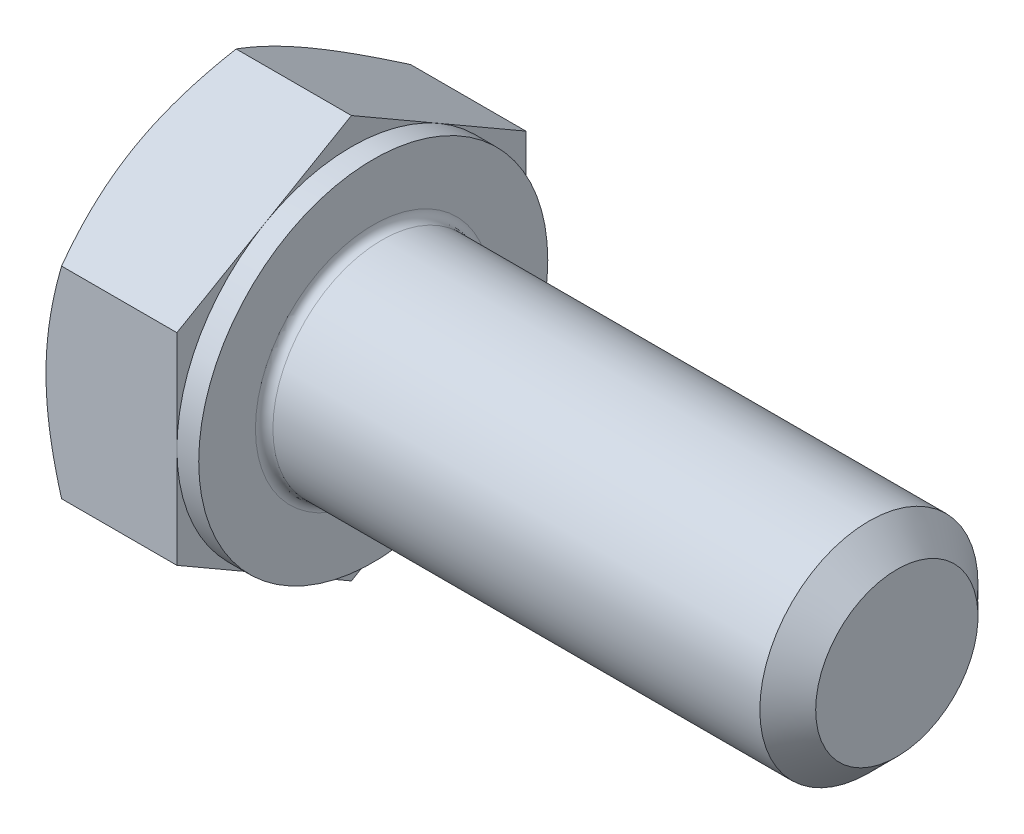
ISO-10303-21;
HEADER;
FILE_DESCRIPTION(('STEP AP214'),'2;1');
FILE_NAME('part.step','',(''),(''),'','','');
FILE_SCHEMA(('AUTOMOTIVE_DESIGN { 1 0 10303 214 1 1 1 1 }'));
ENDSEC;
DATA;
#1=APPLICATION_CONTEXT('core data for automotive mechanical design processes');
#2=APPLICATION_PROTOCOL_DEFINITION('international standard','automotive_design',2000,#1);
#3=PRODUCT_CONTEXT('',#1,'mechanical');
#4=PRODUCT('Part','Part','',(#3));
#5=PRODUCT_RELATED_PRODUCT_CATEGORY('part','',(#4));
#6=PRODUCT_DEFINITION_FORMATION('','',#4);
#7=PRODUCT_DEFINITION_CONTEXT('part definition',#1,'design');
#8=PRODUCT_DEFINITION('design','',#6,#7);
#9=PRODUCT_DEFINITION_SHAPE('','',#8);
#10=(LENGTH_UNIT() NAMED_UNIT(*) SI_UNIT(.MILLI.,.METRE.));
#11=(NAMED_UNIT(*) PLANE_ANGLE_UNIT() SI_UNIT($,.RADIAN.));
#12=(NAMED_UNIT(*) SI_UNIT($,.STERADIAN.) SOLID_ANGLE_UNIT());
#13=UNCERTAINTY_MEASURE_WITH_UNIT(LENGTH_MEASURE(1.E-05),#10,'distance_accuracy_value','');
#14=(GEOMETRIC_REPRESENTATION_CONTEXT(3) GLOBAL_UNCERTAINTY_ASSIGNED_CONTEXT((#13)) GLOBAL_UNIT_ASSIGNED_CONTEXT((#10,
#11,#12)) REPRESENTATION_CONTEXT('',''));
#15=CARTESIAN_POINT('',(0.,0.,0.));
#16=DIRECTION('',(0.,0.,1.));
#17=DIRECTION('',(1.,0.,0.));
#18=AXIS2_PLACEMENT_3D('',#15,#16,#17);
#19=CARTESIAN_POINT('',(3.5,2.3094010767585,-4.));
#20=DIRECTION('',(0.,-0.866025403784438,0.500000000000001));
#21=DIRECTION('',(0.,-0.500000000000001,-0.866025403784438));
#22=AXIS2_PLACEMENT_3D('',#19,#20,#21);
#23=PLANE('',#22);
#24=DIRECTION('',(0.,0.500000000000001,0.866025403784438));
#25=VECTOR('',#24,1.);
#26=CARTESIAN_POINT('',(3.,2.3094010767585,-4.));
#27=LINE('',#26,#25);
#28=CARTESIAN_POINT('',(3.,2.3094010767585,-4.));
#29=VERTEX_POINT('',#28);
#30=CARTESIAN_POINT('',(3.,3.46410161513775,-2.));
#31=VERTEX_POINT('',#30);
#32=EDGE_CURVE('E173',#29,#31,#27,.T.);
#33=ORIENTED_EDGE('',*,*,#32,.F.);
#34=DIRECTION('',(-1.,0.,0.));
#35=VECTOR('',#34,1.);
#36=CARTESIAN_POINT('',(3.5,2.3094010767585,-4.));
#37=LINE('',#36,#35);
#38=CARTESIAN_POINT('',(0.357265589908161,2.3094010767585,-4.));
#39=VERTEX_POINT('',#38);
#40=EDGE_CURVE('E301',#29,#39,#37,.T.);
#41=ORIENTED_EDGE('',*,*,#40,.T.);
#42=CARTESIAN_POINT('',(0.357332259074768,4.61891762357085,0.0002));
#43=CARTESIAN_POINT('',(0.298717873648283,4.51743148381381,-0.175579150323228));
#44=CARTESIAN_POINT('',(0.245410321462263,4.41506932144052,-0.35287561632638));
#45=CARTESIAN_POINT('',(0.152361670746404,4.2085725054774,-0.710538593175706));
#46=CARTESIAN_POINT('',(0.112653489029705,4.10443418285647,-0.890911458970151));
#47=CARTESIAN_POINT('',(0.05084221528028,3.89744813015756,-1.24942181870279));
#48=CARTESIAN_POINT('',(0.0283277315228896,3.7946322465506,-1.42750415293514));
#49=CARTESIAN_POINT('',(0.00145062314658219,3.58851671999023,-1.78450671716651));
#50=CARTESIAN_POINT('',(-0.0029342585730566,3.48521782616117,-1.9634256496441));
#51=CARTESIAN_POINT('',(0.00619007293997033,3.29219970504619,-2.29774284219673));
#52=CARTESIAN_POINT('',(0.0174589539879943,3.20245157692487,-2.45319115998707));
#53=CARTESIAN_POINT('',(0.053173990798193,3.02354002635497,-2.76307505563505));
#54=CARTESIAN_POINT('',(0.0776323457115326,2.93437722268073,-2.91750956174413));
#55=CARTESIAN_POINT('',(0.138776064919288,2.75509682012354,-3.22803232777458));
#56=CARTESIAN_POINT('',(0.175720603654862,2.6650019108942,-3.3840812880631));
#57=CARTESIAN_POINT('',(0.259570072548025,2.48615580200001,-3.69385183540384));
#58=CARTESIAN_POINT('',(0.306455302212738,2.39740231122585,-3.84757739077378));
#59=CARTESIAN_POINT('',(0.357332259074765,2.30928560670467,-4.0002));
#60=B_SPLINE_CURVE_WITH_KNOTS('',3,(#42,#43,#44,#45,#46,#47,#48,#49,#50,#51,#52,#53,#54,#55,#56,
#57,#58,#59),.UNSPECIFIED.,.F.,.F.,(4,2,2,2,2,2,2,2,4),(0.,0.634047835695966,1.26961969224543,
1.88946157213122,2.50854226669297,3.04757825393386,3.58711366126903,4.13861653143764,
4.68903648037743),.UNSPECIFIED.);
#61=CARTESIAN_POINT('',(0.,3.46410161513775,-2.));
#62=VERTEX_POINT('',#61);
#63=EDGE_CURVE('E228',#62,#39,#60,.T.);
#64=ORIENTED_EDGE('',*,*,#63,.F.);
#65=CARTESIAN_POINT('',(0.357265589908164,4.61880215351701,0.));
#66=VERTEX_POINT('',#65);
#67=EDGE_CURVE('E64',#66,#62,#60,.T.);
#68=ORIENTED_EDGE('',*,*,#67,.F.);
#69=DIRECTION('',(-1.,0.,0.));
#70=VECTOR('',#69,1.);
#71=CARTESIAN_POINT('',(3.5,4.61880215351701,0.));
#72=LINE('',#71,#70);
#73=CARTESIAN_POINT('',(3.,4.61880215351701,0.));
#74=VERTEX_POINT('',#73);
#75=EDGE_CURVE('E293',#74,#66,#72,.T.);
#76=ORIENTED_EDGE('',*,*,#75,.F.);
#77=EDGE_CURVE('E171',#31,#74,#27,.T.);
#78=ORIENTED_EDGE('',*,*,#77,.F.);
#79=EDGE_LOOP('',(#33,#41,#64,#68,#76,#78));
#80=FACE_BOUND('',#79,.T.);
#81=ADVANCED_FACE('F41',(#80),#23,.F.);
#82=CARTESIAN_POINT('',(3.5,4.61880215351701,0.));
#83=DIRECTION('',(0.,-0.866025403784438,-0.500000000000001));
#84=DIRECTION('',(0.,0.500000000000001,-0.866025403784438));
#85=AXIS2_PLACEMENT_3D('',#82,#83,#84);
#86=PLANE('',#85);
#87=DIRECTION('',(0.,-0.500000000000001,0.866025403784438));
#88=VECTOR('',#87,1.);
#89=CARTESIAN_POINT('',(3.,4.61880215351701,0.));
#90=LINE('',#89,#88);
#91=CARTESIAN_POINT('',(3.,3.46410161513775,2.));
#92=VERTEX_POINT('',#91);
#93=EDGE_CURVE('E170',#74,#92,#90,.T.);
#94=ORIENTED_EDGE('',*,*,#93,.F.);
#95=ORIENTED_EDGE('',*,*,#75,.T.);
#96=CARTESIAN_POINT('',(0.357332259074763,2.30928560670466,4.0002));
#97=CARTESIAN_POINT('',(0.298717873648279,2.4107717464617,3.82442084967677));
#98=CARTESIAN_POINT('',(0.24541032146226,2.51313390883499,3.64712438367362));
#99=CARTESIAN_POINT('',(0.152361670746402,2.71963072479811,3.28946140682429));
#100=CARTESIAN_POINT('',(0.112653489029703,2.82376904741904,3.10908854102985));
#101=CARTESIAN_POINT('',(0.0508422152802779,3.03075510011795,2.75057818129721));
#102=CARTESIAN_POINT('',(0.0283277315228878,3.13357098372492,2.57249584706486));
#103=CARTESIAN_POINT('',(0.00145062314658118,3.33968651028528,2.21549328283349));
#104=CARTESIAN_POINT('',(-0.00293425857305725,3.44298540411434,2.0365743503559));
#105=CARTESIAN_POINT('',(0.0061900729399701,3.63600352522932,1.70225715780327));
#106=CARTESIAN_POINT('',(0.0174589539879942,3.72575165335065,1.54680884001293));
#107=CARTESIAN_POINT('',(0.0531739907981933,3.90466320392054,1.23692494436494));
#108=CARTESIAN_POINT('',(0.0776323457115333,3.99382600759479,1.08249043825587));
#109=CARTESIAN_POINT('',(0.13877606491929,4.17310641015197,0.771967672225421));
#110=CARTESIAN_POINT('',(0.175720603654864,4.26320131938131,0.615918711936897));
#111=CARTESIAN_POINT('',(0.259570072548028,4.44204742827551,0.30614816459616));
#112=CARTESIAN_POINT('',(0.306455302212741,4.53080091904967,0.15242260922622));
#113=CARTESIAN_POINT('',(0.357332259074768,4.61891762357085,-0.000200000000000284));
#114=B_SPLINE_CURVE_WITH_KNOTS('',3,(#96,#97,#98,#99,#100,#101,#102,#103,#104,#105,#106,#107,
#108,#109,#110,#111,#112,#113),.UNSPECIFIED.,.F.,.F.,(4,2,2,2,2,2,2,2,4),(0.,0.634047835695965,
1.26961969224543,1.88946157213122,2.50854226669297,3.04757825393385,3.58711366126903,
4.13861653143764,4.68903648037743),.UNSPECIFIED.);
#115=CARTESIAN_POINT('',(0.,3.46410161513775,2.));
#116=VERTEX_POINT('',#115);
#117=EDGE_CURVE('E225',#116,#66,#114,.T.);
#118=ORIENTED_EDGE('',*,*,#117,.F.);
#119=CARTESIAN_POINT('',(0.35726558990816,2.3094010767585,4.));
#120=VERTEX_POINT('',#119);
#121=EDGE_CURVE('E239',#120,#116,#114,.T.);
#122=ORIENTED_EDGE('',*,*,#121,.F.);
#123=DIRECTION('',(-1.,0.,0.));
#124=VECTOR('',#123,1.);
#125=CARTESIAN_POINT('',(3.5,2.3094010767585,4.));
#126=LINE('',#125,#124);
#127=CARTESIAN_POINT('',(3.,2.3094010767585,4.));
#128=VERTEX_POINT('',#127);
#129=EDGE_CURVE('E295',#128,#120,#126,.T.);
#130=ORIENTED_EDGE('',*,*,#129,.F.);
#131=EDGE_CURVE('E138',#92,#128,#90,.T.);
#132=ORIENTED_EDGE('',*,*,#131,.F.);
#133=EDGE_LOOP('',(#94,#95,#118,#122,#130,#132));
#134=FACE_BOUND('',#133,.T.);
#135=ADVANCED_FACE('F246',(#134),#86,.F.);
#136=CARTESIAN_POINT('',(3.5,2.3094010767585,4.));
#137=DIRECTION('',(0.,0.,-1.));
#138=DIRECTION('',(0.,1.,0.));
#139=AXIS2_PLACEMENT_3D('',#136,#137,#138);
#140=PLANE('',#139);
#141=DIRECTION('',(0.,-1.,0.));
#142=VECTOR('',#141,1.);
#143=CARTESIAN_POINT('',(3.,2.3094010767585,4.));
#144=LINE('',#143,#142);
#145=CARTESIAN_POINT('',(3.,0.,4.));
#146=VERTEX_POINT('',#145);
#147=EDGE_CURVE('E132',#128,#146,#144,.T.);
#148=ORIENTED_EDGE('',*,*,#147,.F.);
#149=ORIENTED_EDGE('',*,*,#129,.T.);
#150=CARTESIAN_POINT('',(2.00011120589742,-6.30203842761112,4.));
#151=CARTESIAN_POINT('',(1.91454696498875,-6.12645846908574,4.));
#152=CARTESIAN_POINT('',(1.82977515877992,-5.95048585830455,4.));
#153=CARTESIAN_POINT('',(1.66226027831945,-5.59754684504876,4.));
#154=CARTESIAN_POINT('',(1.57951750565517,-5.42058029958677,4.));
#155=CARTESIAN_POINT('',(1.41610926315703,-5.06457985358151,4.));
#156=CARTESIAN_POINT('',(1.33545672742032,-4.88553999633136,4.));
#157=CARTESIAN_POINT('',(1.17732358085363,-4.52607013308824,4.));
#158=CARTESIAN_POINT('',(1.09984282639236,-4.34564019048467,4.));
#159=CARTESIAN_POINT('',(0.946328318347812,-3.97695712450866,4.));
#160=CARTESIAN_POINT('',(0.870432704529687,-3.7886461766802,4.));
#161=CARTESIAN_POINT('',(0.724150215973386,-3.40985798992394,4.));
#162=CARTESIAN_POINT('',(0.653763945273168,-3.21938051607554,4.));
#163=CARTESIAN_POINT('',(0.52027562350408,-2.83628177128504,4.));
#164=CARTESIAN_POINT('',(0.457159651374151,-2.64366539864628,4.));
#165=CARTESIAN_POINT('',(0.340171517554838,-2.25567134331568,4.));
#166=CARTESIAN_POINT('',(0.286296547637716,-2.06029451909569,4.));
#167=CARTESIAN_POINT('',(0.190596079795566,-1.66775019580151,4.));
#168=CARTESIAN_POINT('',(0.148703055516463,-1.47059946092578,4.));
#169=CARTESIAN_POINT('',(0.0792701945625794,-1.07374632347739,4.));
#170=CARTESIAN_POINT('',(0.0517287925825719,-0.874044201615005,4.));
#171=CARTESIAN_POINT('',(0.0135517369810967,-0.475733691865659,4.));
#172=CARTESIAN_POINT('',(0.00269106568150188,-0.277147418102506,4.));
#173=CARTESIAN_POINT('',(-0.0018027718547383,0.120241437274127,4.));
#174=CARTESIAN_POINT('',(0.00456430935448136,0.31904402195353,4.));
#175=CARTESIAN_POINT('',(0.029319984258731,0.653649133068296,4.));
#176=CARTESIAN_POINT('',(0.0433487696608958,0.789796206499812,4.));
#177=CARTESIAN_POINT('',(0.0786650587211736,1.0611517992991,4.));
#178=CARTESIAN_POINT('',(0.0999534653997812,1.1963601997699,4.));
#179=CARTESIAN_POINT('',(0.173595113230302,1.6003610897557,4.));
#180=CARTESIAN_POINT('',(0.235713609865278,1.86739658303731,4.));
#181=CARTESIAN_POINT('',(0.344187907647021,2.26690842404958,4.));
#182=CARTESIAN_POINT('',(0.383434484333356,2.40143348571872,4.));
#183=CARTESIAN_POINT('',(0.466191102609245,2.66917849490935,4.));
#184=CARTESIAN_POINT('',(0.509701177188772,2.8023984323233,4.));
#185=CARTESIAN_POINT('',(0.600271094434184,3.06757339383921,4.));
#186=CARTESIAN_POINT('',(0.647329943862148,3.19952876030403,4.));
#187=CARTESIAN_POINT('',(0.744425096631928,3.46233234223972,4.));
#188=CARTESIAN_POINT('',(0.794461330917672,3.5931805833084,4.));
#189=CARTESIAN_POINT('',(0.933355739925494,3.9462730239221,4.));
#190=CARTESIAN_POINT('',(1.0245987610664,4.16757823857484,4.));
#191=CARTESIAN_POINT('',(1.21247228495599,4.6078984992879,4.));
#192=CARTESIAN_POINT('',(1.30910339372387,4.82691328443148,4.));
#193=CARTESIAN_POINT('',(1.50647026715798,5.26317250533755,4.));
#194=CARTESIAN_POINT('',(1.60720747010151,5.48041628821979,4.));
#195=CARTESIAN_POINT('',(1.81181128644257,5.91342831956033,4.));
#196=CARTESIAN_POINT('',(1.91567799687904,6.12919652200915,3.99999999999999));
#197=CARTESIAN_POINT('',(2.12601769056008,6.55988022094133,3.99999999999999));
#198=CARTESIAN_POINT('',(2.23249454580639,6.77479382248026,3.99999999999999));
#199=CARTESIAN_POINT('',(2.44739203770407,7.20364803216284,3.99999999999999));
#200=CARTESIAN_POINT('',(2.55581269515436,7.41758862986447,3.99999999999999));
#201=CARTESIAN_POINT('',(2.88334503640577,8.05812603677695,3.99999999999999));
#202=CARTESIAN_POINT('',(3.10477549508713,8.48353660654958,3.99999999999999));
#203=CARTESIAN_POINT('',(3.52798949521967,9.28704830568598,3.99999999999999));
#204=CARTESIAN_POINT('',(3.72935795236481,9.66536913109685,3.99999999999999));
#205=CARTESIAN_POINT('',(4.13451859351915,10.4207405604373,3.99999999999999));
#206=CARTESIAN_POINT('',(4.33831092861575,10.7977910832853,3.99999999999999));
#207=CARTESIAN_POINT('',(4.74699525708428,11.5496417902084,3.99999999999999));
#208=CARTESIAN_POINT('',(4.95188119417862,11.9244452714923,3.99999999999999));
#209=CARTESIAN_POINT('',(5.36302659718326,12.6732594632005,3.99999999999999));
#210=CARTESIAN_POINT('',(5.56928595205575,13.0472702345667,3.99999999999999));
#211=CARTESIAN_POINT('',(5.7760450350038,13.42100281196,3.99999999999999));
#212=B_SPLINE_CURVE_WITH_KNOTS('',3,(#150,#151,#152,#153,#154,#155,#156,#157,#158,#159,#160,
#161,#162,#163,#164,#165,#166,#167,#168,#169,#170,#171,#172,#173,#174,#175,#176,#177,#178,#179,
#180,#181,#182,#183,#184,#185,#186,#187,#188,#189,#190,#191,#192,#193,#194,#195,#196,#197,#198,
#199,#200,#201,#202,#203,#204,#205,#206,#207,#208,#209,#210,#211),.UNSPECIFIED.,.F.,.F.,(4,2,2,
2,2,2,2,2,2,2,2,2,2,2,2,2,2,2,2,2,2,2,2,2,2,2,2,2,2,2,4),(0.,0.585964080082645,1.17201473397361,
1.76109183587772,2.35014223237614,2.95916537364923,3.56825519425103,4.17615863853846,
4.78387701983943,5.38809979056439,5.99225664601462,6.58818973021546,7.18413137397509,
7.59453803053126,8.00499575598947,8.82630884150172,9.24666973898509,9.66703388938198,
10.0872808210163,10.5075180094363,11.2255416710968,11.9436462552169,12.6620045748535,
13.3803851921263,14.0999050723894,14.8194326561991,16.2581595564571,17.5438734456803,
18.8296679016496,20.1111105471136,21.3924508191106),.UNSPECIFIED.);
#213=CARTESIAN_POINT('',(0.,0.,4.));
#214=VERTEX_POINT('',#213);
#215=EDGE_CURVE('E240',#214,#120,#212,.T.);
#216=ORIENTED_EDGE('',*,*,#215,.F.);
#217=CARTESIAN_POINT('',(0.357265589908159,-2.3094010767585,4.));
#218=VERTEX_POINT('',#217);
#219=EDGE_CURVE('E302',#218,#214,#212,.T.);
#220=ORIENTED_EDGE('',*,*,#219,.F.);
#221=DIRECTION('',(-1.,0.,0.));
#222=VECTOR('',#221,1.);
#223=CARTESIAN_POINT('',(3.5,-2.3094010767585,4.));
#224=LINE('',#223,#222);
#225=CARTESIAN_POINT('',(3.,-2.3094010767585,4.));
#226=VERTEX_POINT('',#225);
#227=EDGE_CURVE('E164',#226,#218,#224,.T.);
#228=ORIENTED_EDGE('',*,*,#227,.F.);
#229=EDGE_CURVE('E142',#146,#226,#144,.T.);
#230=ORIENTED_EDGE('',*,*,#229,.F.);
#231=EDGE_LOOP('',(#148,#149,#216,#220,#228,#230));
#232=FACE_BOUND('',#231,.T.);
#233=ADVANCED_FACE('F162',(#232),#140,.F.);
#234=CARTESIAN_POINT('',(3.5,-4.618802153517,0.));
#235=DIRECTION('',(0.,0.866025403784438,-0.500000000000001));
#236=DIRECTION('',(0.,0.500000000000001,0.866025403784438));
#237=AXIS2_PLACEMENT_3D('',#234,#235,#236);
#238=PLANE('',#237);
#239=DIRECTION('',(0.,-0.500000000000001,-0.866025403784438));
#240=VECTOR('',#239,1.);
#241=CARTESIAN_POINT('',(3.,-4.618802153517,0.));
#242=LINE('',#241,#240);
#243=CARTESIAN_POINT('',(3.,-3.46410161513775,2.));
#244=VERTEX_POINT('',#243);
#245=EDGE_CURVE('E149',#226,#244,#242,.T.);
#246=ORIENTED_EDGE('',*,*,#245,.F.);
#247=ORIENTED_EDGE('',*,*,#227,.T.);
#248=CARTESIAN_POINT('',(0.357332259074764,-4.61891762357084,-0.000199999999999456));
#249=CARTESIAN_POINT('',(0.29871787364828,-4.5174314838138,0.175579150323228));
#250=CARTESIAN_POINT('',(0.24541032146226,-4.41506932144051,0.352875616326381));
#251=CARTESIAN_POINT('',(0.152361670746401,-4.20857250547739,0.710538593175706));
#252=CARTESIAN_POINT('',(0.112653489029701,-4.10443418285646,0.890911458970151));
#253=CARTESIAN_POINT('',(0.0508422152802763,-3.89744813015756,1.24942181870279));
#254=CARTESIAN_POINT('',(0.0283277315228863,-3.79463224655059,1.42750415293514));
#255=CARTESIAN_POINT('',(0.00145062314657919,-3.58851671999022,1.78450671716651));
#256=CARTESIAN_POINT('',(-0.00293425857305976,-3.48521782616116,1.9634256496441));
#257=CARTESIAN_POINT('',(0.0061900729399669,-3.29219970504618,2.29774284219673));
#258=CARTESIAN_POINT('',(0.0174589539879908,-3.20245157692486,2.45319115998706));
#259=CARTESIAN_POINT('',(0.0531739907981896,-3.02354002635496,2.76307505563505));
#260=CARTESIAN_POINT('',(0.0776323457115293,-2.93437722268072,2.91750956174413));
#261=CARTESIAN_POINT('',(0.138776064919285,-2.75509682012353,3.22803232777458));
#262=CARTESIAN_POINT('',(0.17572060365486,-2.66500191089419,3.3840812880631));
#263=CARTESIAN_POINT('',(0.259570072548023,-2.486155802,3.69385183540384));
#264=CARTESIAN_POINT('',(0.306455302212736,-2.39740231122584,3.84757739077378));
#265=CARTESIAN_POINT('',(0.357332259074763,-2.30928560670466,4.0002));
#266=B_SPLINE_CURVE_WITH_KNOTS('',3,(#248,#249,#250,#251,#252,#253,#254,#255,#256,#257,#258,
#259,#260,#261,#262,#263,#264,#265),.UNSPECIFIED.,.F.,.F.,(4,2,2,2,2,2,2,2,4),(0.,
0.634047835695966,1.26961969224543,1.88946157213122,2.50854226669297,3.04757825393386,
3.58711366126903,4.13861653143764,4.68903648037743),.UNSPECIFIED.);
#267=CARTESIAN_POINT('',(0.,-3.46410161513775,2.));
#268=VERTEX_POINT('',#267);
#269=EDGE_CURVE('E227',#268,#218,#266,.T.);
#270=ORIENTED_EDGE('',*,*,#269,.F.);
#271=CARTESIAN_POINT('',(0.357265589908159,-4.618802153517,0.));
#272=VERTEX_POINT('',#271);
#273=EDGE_CURVE('E219',#272,#268,#266,.T.);
#274=ORIENTED_EDGE('',*,*,#273,.F.);
#275=DIRECTION('',(-1.,0.,0.));
#276=VECTOR('',#275,1.);
#277=CARTESIAN_POINT('',(3.5,-4.618802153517,0.));
#278=LINE('',#277,#276);
#279=CARTESIAN_POINT('',(3.,-4.618802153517,0.));
#280=VERTEX_POINT('',#279);
#281=EDGE_CURVE('E298',#280,#272,#278,.T.);
#282=ORIENTED_EDGE('',*,*,#281,.F.);
#283=EDGE_CURVE('E165',#244,#280,#242,.T.);
#284=ORIENTED_EDGE('',*,*,#283,.F.);
#285=EDGE_LOOP('',(#246,#247,#270,#274,#282,#284));
#286=FACE_BOUND('',#285,.T.);
#287=ADVANCED_FACE('F210',(#286),#238,.F.);
#288=CARTESIAN_POINT('',(3.5,-2.3094010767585,-4.));
#289=DIRECTION('',(0.,0.866025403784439,0.5));
#290=DIRECTION('',(0.,-0.5,0.866025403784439));
#291=AXIS2_PLACEMENT_3D('',#288,#289,#290);
#292=PLANE('',#291);
#293=DIRECTION('',(0.,0.5,-0.866025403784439));
#294=VECTOR('',#293,1.);
#295=CARTESIAN_POINT('',(3.,-2.3094010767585,-4.));
#296=LINE('',#295,#294);
#297=CARTESIAN_POINT('',(3.,-3.46410161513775,-2.));
#298=VERTEX_POINT('',#297);
#299=EDGE_CURVE('E348',#280,#298,#296,.T.);
#300=ORIENTED_EDGE('',*,*,#299,.F.);
#301=ORIENTED_EDGE('',*,*,#281,.T.);
#302=CARTESIAN_POINT('',(0.357332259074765,-2.30928560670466,-4.0002));
#303=CARTESIAN_POINT('',(0.298717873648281,-2.4107717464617,-3.82442084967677));
#304=CARTESIAN_POINT('',(0.245410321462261,-2.51313390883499,-3.64712438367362));
#305=CARTESIAN_POINT('',(0.152361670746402,-2.71963072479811,-3.28946140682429));
#306=CARTESIAN_POINT('',(0.112653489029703,-2.82376904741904,-3.10908854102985));
#307=CARTESIAN_POINT('',(0.0508422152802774,-3.03075510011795,-2.75057818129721));
#308=CARTESIAN_POINT('',(0.028327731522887,-3.13357098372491,-2.57249584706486));
#309=CARTESIAN_POINT('',(0.00145062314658,-3.33968651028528,-2.21549328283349));
#310=CARTESIAN_POINT('',(-0.00293425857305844,-3.44298540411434,-2.0365743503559));
#311=CARTESIAN_POINT('',(0.00619007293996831,-3.63600352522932,-1.70225715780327));
#312=CARTESIAN_POINT('',(0.0174589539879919,-3.72575165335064,-1.54680884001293));
#313=CARTESIAN_POINT('',(0.0531739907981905,-3.90466320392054,-1.23692494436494));
#314=CARTESIAN_POINT('',(0.0776323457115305,-3.99382600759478,-1.08249043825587));
#315=CARTESIAN_POINT('',(0.138776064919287,-4.17310641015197,-0.771967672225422));
#316=CARTESIAN_POINT('',(0.17572060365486,-4.26320131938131,-0.615918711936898));
#317=CARTESIAN_POINT('',(0.259570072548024,-4.4420474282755,-0.306148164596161));
#318=CARTESIAN_POINT('',(0.306455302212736,-4.53080091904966,-0.152422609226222));
#319=CARTESIAN_POINT('',(0.357332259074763,-4.61891762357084,0.000199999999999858));
#320=B_SPLINE_CURVE_WITH_KNOTS('',3,(#302,#303,#304,#305,#306,#307,#308,#309,#310,#311,#312,
#313,#314,#315,#316,#317,#318,#319),.UNSPECIFIED.,.F.,.F.,(4,2,2,2,2,2,2,2,4),(0.,
0.634047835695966,1.26961969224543,1.88946157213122,2.50854226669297,3.04757825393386,
3.58711366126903,4.13861653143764,4.68903648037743),.UNSPECIFIED.);
#321=CARTESIAN_POINT('',(0.,-3.46410161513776,-2.));
#322=VERTEX_POINT('',#321);
#323=EDGE_CURVE('E226',#322,#272,#320,.T.);
#324=ORIENTED_EDGE('',*,*,#323,.F.);
#325=CARTESIAN_POINT('',(0.357265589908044,-2.30940107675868,-4.));
#326=VERTEX_POINT('',#325);
#327=EDGE_CURVE('E187',#326,#322,#320,.T.);
#328=ORIENTED_EDGE('',*,*,#327,.F.);
#329=DIRECTION('',(-1.,0.,0.));
#330=VECTOR('',#329,1.);
#331=CARTESIAN_POINT('',(3.5,-2.3094010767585,-4.));
#332=LINE('',#331,#330);
#333=CARTESIAN_POINT('',(3.,-2.3094010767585,-4.));
#334=VERTEX_POINT('',#333);
#335=EDGE_CURVE('E300',#334,#326,#332,.T.);
#336=ORIENTED_EDGE('',*,*,#335,.F.);
#337=EDGE_CURVE('E160',#298,#334,#296,.T.);
#338=ORIENTED_EDGE('',*,*,#337,.F.);
#339=EDGE_LOOP('',(#300,#301,#324,#328,#336,#338));
#340=FACE_BOUND('',#339,.T.);
#341=ADVANCED_FACE('F203',(#340),#292,.F.);
#342=CARTESIAN_POINT('',(3.5,2.3094010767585,-4.));
#343=DIRECTION('',(0.,0.,1.));
#344=DIRECTION('',(0.,-1.,0.));
#345=AXIS2_PLACEMENT_3D('',#342,#343,#344);
#346=PLANE('',#345);
#347=DIRECTION('',(0.,1.,0.));
#348=VECTOR('',#347,1.);
#349=CARTESIAN_POINT('',(3.,2.3094010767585,-4.));
#350=LINE('',#349,#348);
#351=CARTESIAN_POINT('',(3.,0.,-4.));
#352=VERTEX_POINT('',#351);
#353=EDGE_CURVE('E272',#334,#352,#350,.T.);
#354=ORIENTED_EDGE('',*,*,#353,.F.);
#355=ORIENTED_EDGE('',*,*,#335,.T.);
#356=CARTESIAN_POINT('',(2.00011120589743,-6.30203842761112,-4.));
#357=CARTESIAN_POINT('',(1.91454696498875,-6.12645846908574,-4.));
#358=CARTESIAN_POINT('',(1.82977515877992,-5.95048585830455,-4.));
#359=CARTESIAN_POINT('',(1.66226027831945,-5.59754684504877,-4.));
#360=CARTESIAN_POINT('',(1.57951750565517,-5.42058029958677,-4.));
#361=CARTESIAN_POINT('',(1.41610926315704,-5.06457985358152,-4.));
#362=CARTESIAN_POINT('',(1.33545672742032,-4.88553999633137,-4.));
#363=CARTESIAN_POINT('',(1.17732358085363,-4.52607013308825,-4.));
#364=CARTESIAN_POINT('',(1.09984282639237,-4.34564019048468,-4.));
#365=CARTESIAN_POINT('',(0.946328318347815,-3.97695712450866,-4.));
#366=CARTESIAN_POINT('',(0.87043270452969,-3.78864617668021,-4.));
#367=CARTESIAN_POINT('',(0.724150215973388,-3.40985798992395,-4.));
#368=CARTESIAN_POINT('',(0.65376394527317,-3.21938051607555,-4.));
#369=CARTESIAN_POINT('',(0.520275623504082,-2.83628177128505,-4.));
#370=CARTESIAN_POINT('',(0.457159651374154,-2.64366539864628,-4.));
#371=CARTESIAN_POINT('',(0.34017151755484,-2.25567134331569,-4.));
#372=CARTESIAN_POINT('',(0.286296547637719,-2.0602945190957,-4.));
#373=CARTESIAN_POINT('',(0.190596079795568,-1.66775019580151,-4.));
#374=CARTESIAN_POINT('',(0.148703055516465,-1.47059946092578,-4.));
#375=CARTESIAN_POINT('',(0.0792701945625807,-1.07374632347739,-4.));
#376=CARTESIAN_POINT('',(0.051728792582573,-0.874044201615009,-4.));
#377=CARTESIAN_POINT('',(0.0135517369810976,-0.475733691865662,-4.));
#378=CARTESIAN_POINT('',(0.0026910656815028,-0.277147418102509,-4.));
#379=CARTESIAN_POINT('',(-0.0018027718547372,0.120241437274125,-4.));
#380=CARTESIAN_POINT('',(0.00456430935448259,0.319044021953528,-4.));
#381=CARTESIAN_POINT('',(0.0293199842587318,0.653649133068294,-4.));
#382=CARTESIAN_POINT('',(0.0433487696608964,0.78979620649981,-4.));
#383=CARTESIAN_POINT('',(0.078665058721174,1.06115179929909,-4.));
#384=CARTESIAN_POINT('',(0.0999534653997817,1.19636019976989,-4.));
#385=CARTESIAN_POINT('',(0.173595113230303,1.6003610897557,-4.));
#386=CARTESIAN_POINT('',(0.235713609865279,1.86739658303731,-4.));
#387=CARTESIAN_POINT('',(0.344187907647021,2.26690842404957,-4.));
#388=CARTESIAN_POINT('',(0.383434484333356,2.40143348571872,-4.));
#389=CARTESIAN_POINT('',(0.466191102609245,2.66917849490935,-4.));
#390=CARTESIAN_POINT('',(0.509701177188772,2.8023984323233,-4.));
#391=CARTESIAN_POINT('',(0.600271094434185,3.06757339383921,-4.));
#392=CARTESIAN_POINT('',(0.647329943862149,3.19952876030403,-4.));
#393=CARTESIAN_POINT('',(0.744425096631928,3.46233234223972,-4.));
#394=CARTESIAN_POINT('',(0.794461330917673,3.5931805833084,-4.));
#395=CARTESIAN_POINT('',(0.933355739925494,3.9462730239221,-4.));
#396=CARTESIAN_POINT('',(1.0245987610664,4.16757823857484,-4.));
#397=CARTESIAN_POINT('',(1.21247228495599,4.6078984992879,-4.));
#398=CARTESIAN_POINT('',(1.30910339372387,4.82691328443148,-4.));
#399=CARTESIAN_POINT('',(1.50647026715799,5.26317250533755,-4.));
#400=CARTESIAN_POINT('',(1.60720747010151,5.48041628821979,-4.));
#401=CARTESIAN_POINT('',(1.81181128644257,5.91342831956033,-4.));
#402=CARTESIAN_POINT('',(1.91567799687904,6.12919652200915,-4.));
#403=CARTESIAN_POINT('',(2.12601769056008,6.55988022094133,-4.));
#404=CARTESIAN_POINT('',(2.23249454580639,6.77479382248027,-4.));
#405=CARTESIAN_POINT('',(2.44739203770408,7.20364803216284,-4.));
#406=CARTESIAN_POINT('',(2.55581269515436,7.41758862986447,-4.));
#407=CARTESIAN_POINT('',(2.88334503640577,8.05812603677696,-4.));
#408=CARTESIAN_POINT('',(3.10477549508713,8.48353660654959,-4.));
#409=CARTESIAN_POINT('',(3.52798949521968,9.28704830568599,-4.));
#410=CARTESIAN_POINT('',(3.72935795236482,9.66536913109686,-4.));
#411=CARTESIAN_POINT('',(4.13451859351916,10.4207405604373,-4.));
#412=CARTESIAN_POINT('',(4.33831092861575,10.7977910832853,-3.99999999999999));
#413=CARTESIAN_POINT('',(4.74699525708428,11.5496417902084,-3.99999999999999));
#414=CARTESIAN_POINT('',(4.95188119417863,11.9244452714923,-3.99999999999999));
#415=CARTESIAN_POINT('',(5.36302659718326,12.6732594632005,-3.99999999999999));
#416=CARTESIAN_POINT('',(5.56928595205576,13.0472702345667,-3.99999999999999));
#417=CARTESIAN_POINT('',(5.7760450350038,13.42100281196,-3.99999999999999));
#418=B_SPLINE_CURVE_WITH_KNOTS('',3,(#356,#357,#358,#359,#360,#361,#362,#363,#364,#365,#366,
#367,#368,#369,#370,#371,#372,#373,#374,#375,#376,#377,#378,#379,#380,#381,#382,#383,#384,#385,
#386,#387,#388,#389,#390,#391,#392,#393,#394,#395,#396,#397,#398,#399,#400,#401,#402,#403,#404,
#405,#406,#407,#408,#409,#410,#411,#412,#413,#414,#415,#416,#417),.UNSPECIFIED.,.F.,.F.,(4,2,2,
2,2,2,2,2,2,2,2,2,2,2,2,2,2,2,2,2,2,2,2,2,2,2,2,2,2,2,4),(0.,0.585964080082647,1.17201473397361,
1.76109183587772,2.35014223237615,2.95916537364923,3.56825519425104,4.17615863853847,
4.78387701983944,5.38809979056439,5.99225664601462,6.58818973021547,7.1841313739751,
7.59453803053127,8.00499575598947,8.82630884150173,9.2466697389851,9.66703388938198,
10.0872808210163,10.5075180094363,11.2255416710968,11.9436462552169,12.6620045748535,
13.3803851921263,14.0999050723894,14.8194326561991,16.2581595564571,17.5438734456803,
18.8296679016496,20.1111105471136,21.3924508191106),.UNSPECIFIED.);
#419=CARTESIAN_POINT('',(0.,0.,-4.));
#420=VERTEX_POINT('',#419);
#421=EDGE_CURVE('E177',#420,#326,#418,.F.);
#422=ORIENTED_EDGE('',*,*,#421,.F.);
#423=EDGE_CURVE('E186',#39,#420,#418,.F.);
#424=ORIENTED_EDGE('',*,*,#423,.F.);
#425=ORIENTED_EDGE('',*,*,#40,.F.);
#426=EDGE_CURVE('E276',#352,#29,#350,.T.);
#427=ORIENTED_EDGE('',*,*,#426,.F.);
#428=EDGE_LOOP('',(#354,#355,#422,#424,#425,#427));
#429=FACE_BOUND('',#428,.T.);
#430=ADVANCED_FACE('F198',(#429),#346,.F.);
#431=CARTESIAN_POINT('',(0.,0.,0.));
#432=DIRECTION('',(1.,0.,0.));
#433=DIRECTION('',(0.,0.,-1.));
#434=AXIS2_PLACEMENT_3D('',#431,#432,#433);
#435=CONICAL_SURFACE('',#434,4.,1.0471975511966);
#436=ORIENTED_EDGE('',*,*,#327,.T.);
#437=CARTESIAN_POINT('',(0.,0.,0.));
#438=DIRECTION('',(1.,0.,0.));
#439=DIRECTION('',(0.,0.,-1.));
#440=AXIS2_PLACEMENT_3D('',#437,#438,#439);
#441=CIRCLE('',#440,4.);
#442=EDGE_CURVE('E289',#322,#420,#441,.T.);
#443=ORIENTED_EDGE('',*,*,#442,.T.);
#444=ORIENTED_EDGE('',*,*,#421,.T.);
#445=EDGE_LOOP('',(#436,#443,#444));
#446=FACE_BOUND('',#445,.T.);
#447=ADVANCED_FACE('F202',(#446),#435,.T.);
#448=ORIENTED_EDGE('',*,*,#273,.T.);
#449=EDGE_CURVE('E292',#268,#322,#441,.T.);
#450=ORIENTED_EDGE('',*,*,#449,.T.);
#451=ORIENTED_EDGE('',*,*,#323,.T.);
#452=EDGE_LOOP('',(#448,#450,#451));
#453=FACE_BOUND('',#452,.T.);
#454=ADVANCED_FACE('F345',(#453),#435,.T.);
#455=ORIENTED_EDGE('',*,*,#219,.T.);
#456=EDGE_CURVE('E322',#214,#268,#441,.T.);
#457=ORIENTED_EDGE('',*,*,#456,.T.);
#458=ORIENTED_EDGE('',*,*,#269,.T.);
#459=EDGE_LOOP('',(#455,#457,#458));
#460=FACE_BOUND('',#459,.T.);
#461=ADVANCED_FACE('F194',(#460),#435,.T.);
#462=ORIENTED_EDGE('',*,*,#215,.T.);
#463=ORIENTED_EDGE('',*,*,#121,.T.);
#464=CARTESIAN_POINT('',(0.,0.,0.));
#465=DIRECTION('',(-1.,0.,0.));
#466=DIRECTION('',(0.,0.,1.));
#467=AXIS2_PLACEMENT_3D('',#464,#465,#466);
#468=CIRCLE('',#467,4.);
#469=EDGE_CURVE('E174',#214,#116,#468,.T.);
#470=ORIENTED_EDGE('',*,*,#469,.F.);
#471=EDGE_LOOP('',(#462,#463,#470));
#472=FACE_BOUND('',#471,.T.);
#473=ADVANCED_FACE('F316',(#472),#435,.T.);
#474=ORIENTED_EDGE('',*,*,#117,.T.);
#475=ORIENTED_EDGE('',*,*,#67,.T.);
#476=EDGE_CURVE('E287',#62,#116,#441,.T.);
#477=ORIENTED_EDGE('',*,*,#476,.T.);
#478=EDGE_LOOP('',(#474,#475,#477));
#479=FACE_BOUND('',#478,.T.);
#480=ADVANCED_FACE('F320',(#479),#435,.T.);
#481=ORIENTED_EDGE('',*,*,#63,.T.);
#482=ORIENTED_EDGE('',*,*,#423,.T.);
#483=EDGE_CURVE('E286',#420,#62,#441,.T.);
#484=ORIENTED_EDGE('',*,*,#483,.T.);
#485=EDGE_LOOP('',(#481,#482,#484));
#486=FACE_BOUND('',#485,.T.);
#487=ADVANCED_FACE('F336',(#486),#435,.T.);
#488=CARTESIAN_POINT('',(0.,4.61880215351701,0.));
#489=DIRECTION('',(1.,0.,0.));
#490=DIRECTION('',(0.,0.,-1.));
#491=AXIS2_PLACEMENT_3D('',#488,#489,#490);
#492=PLANE('',#491);
#493=ORIENTED_EDGE('',*,*,#483,.F.);
#494=ORIENTED_EDGE('',*,*,#442,.F.);
#495=ORIENTED_EDGE('',*,*,#449,.F.);
#496=ORIENTED_EDGE('',*,*,#456,.F.);
#497=ORIENTED_EDGE('',*,*,#469,.T.);
#498=ORIENTED_EDGE('',*,*,#476,.F.);
#499=EDGE_LOOP('',(#493,#494,#495,#496,#497,#498));
#500=FACE_BOUND('',#499,.T.);
#501=ADVANCED_FACE('F205',(#500),#492,.F.);
#502=CARTESIAN_POINT('',(3.,4.,0.));
#503=DIRECTION('',(1.,0.,0.));
#504=DIRECTION('',(0.,0.,-1.));
#505=AXIS2_PLACEMENT_3D('',#502,#503,#504);
#506=PLANE('',#505);
#507=ORIENTED_EDGE('',*,*,#32,.T.);
#508=CARTESIAN_POINT('',(3.,0.,0.));
#509=DIRECTION('',(-1.,0.,0.));
#510=DIRECTION('',(0.,0.,1.));
#511=AXIS2_PLACEMENT_3D('',#508,#509,#510);
#512=CIRCLE('',#511,4.);
#513=EDGE_CURVE('E56',#31,#352,#512,.T.);
#514=ORIENTED_EDGE('',*,*,#513,.T.);
#515=ORIENTED_EDGE('',*,*,#426,.T.);
#516=EDGE_LOOP('',(#507,#514,#515));
#517=FACE_BOUND('',#516,.T.);
#518=ADVANCED_FACE('F354',(#517),#506,.T.);
#519=ORIENTED_EDGE('',*,*,#77,.T.);
#520=ORIENTED_EDGE('',*,*,#93,.T.);
#521=EDGE_CURVE('E159',#92,#31,#512,.T.);
#522=ORIENTED_EDGE('',*,*,#521,.T.);
#523=EDGE_LOOP('',(#519,#520,#522));
#524=FACE_BOUND('',#523,.T.);
#525=ADVANCED_FACE('F356',(#524),#506,.T.);
#526=ORIENTED_EDGE('',*,*,#131,.T.);
#527=ORIENTED_EDGE('',*,*,#147,.T.);
#528=EDGE_CURVE('E136',#146,#92,#512,.T.);
#529=ORIENTED_EDGE('',*,*,#528,.T.);
#530=EDGE_LOOP('',(#526,#527,#529));
#531=FACE_BOUND('',#530,.T.);
#532=ADVANCED_FACE('F134',(#531),#506,.T.);
#533=ORIENTED_EDGE('',*,*,#229,.T.);
#534=ORIENTED_EDGE('',*,*,#245,.T.);
#535=EDGE_CURVE('E146',#244,#146,#512,.T.);
#536=ORIENTED_EDGE('',*,*,#535,.T.);
#537=EDGE_LOOP('',(#533,#534,#536));
#538=FACE_BOUND('',#537,.T.);
#539=ADVANCED_FACE('F147',(#538),#506,.T.);
#540=ORIENTED_EDGE('',*,*,#283,.T.);
#541=ORIENTED_EDGE('',*,*,#299,.T.);
#542=EDGE_CURVE('E153',#298,#244,#512,.T.);
#543=ORIENTED_EDGE('',*,*,#542,.T.);
#544=EDGE_LOOP('',(#540,#541,#543));
#545=FACE_BOUND('',#544,.T.);
#546=ADVANCED_FACE('F370',(#545),#506,.T.);
#547=ORIENTED_EDGE('',*,*,#337,.T.);
#548=ORIENTED_EDGE('',*,*,#353,.T.);
#549=EDGE_CURVE('E353',#352,#298,#512,.T.);
#550=ORIENTED_EDGE('',*,*,#549,.T.);
#551=EDGE_LOOP('',(#547,#548,#550));
#552=FACE_BOUND('',#551,.T.);
#553=ADVANCED_FACE('F351',(#552),#506,.T.);
#554=CARTESIAN_POINT('',(0.,0.,0.));
#555=DIRECTION('',(-1.,0.,0.));
#556=DIRECTION('',(0.,0.,1.));
#557=AXIS2_PLACEMENT_3D('',#554,#555,#556);
#558=CYLINDRICAL_SURFACE('',#557,4.);
#559=ORIENTED_EDGE('',*,*,#513,.F.);
#560=ORIENTED_EDGE('',*,*,#521,.F.);
#561=ORIENTED_EDGE('',*,*,#528,.F.);
#562=ORIENTED_EDGE('',*,*,#535,.F.);
#563=ORIENTED_EDGE('',*,*,#542,.F.);
#564=ORIENTED_EDGE('',*,*,#549,.F.);
#565=EDGE_LOOP('',(#559,#560,#561,#562,#563,#564));
#566=FACE_BOUND('',#565,.T.);
#567=CARTESIAN_POINT('',(3.5,0.,0.));
#568=DIRECTION('',(1.,0.,0.));
#569=DIRECTION('',(0.,0.,-1.));
#570=AXIS2_PLACEMENT_3D('',#567,#568,#569);
#571=CIRCLE('',#570,4.);
#572=CARTESIAN_POINT('',(3.5,0.,-4.));
#573=VERTEX_POINT('',#572);
#574=EDGE_CURVE('E285',#573,#573,#571,.T.);
#575=ORIENTED_EDGE('',*,*,#574,.F.);
#576=EDGE_LOOP('',(#575));
#577=FACE_BOUND('',#576,.T.);
#578=ADVANCED_FACE('F156',(#566,#577),#558,.T.);
#579=CARTESIAN_POINT('',(15.5,0.,0.));
#580=DIRECTION('',(-1.,0.,0.));
#581=DIRECTION('',(0.,0.,1.));
#582=AXIS2_PLACEMENT_3D('',#579,#580,#581);
#583=PLANE('',#582);
#584=CARTESIAN_POINT('',(15.5,0.,0.));
#585=DIRECTION('',(-1.,0.,0.));
#586=DIRECTION('',(0.,0.,1.));
#587=AXIS2_PLACEMENT_3D('',#584,#585,#586);
#588=CIRCLE('',#587,1.86);
#589=CARTESIAN_POINT('',(15.5,0.,1.86));
#590=VERTEX_POINT('',#589);
#591=EDGE_CURVE('E267',#590,#590,#588,.F.);
#592=ORIENTED_EDGE('',*,*,#591,.T.);
#593=EDGE_LOOP('',(#592));
#594=FACE_BOUND('',#593,.T.);
#595=ADVANCED_FACE('F364',(#594),#583,.F.);
#596=CARTESIAN_POINT('',(0.,0.,0.));
#597=DIRECTION('',(-1.,0.,0.));
#598=DIRECTION('',(0.,0.,1.));
#599=AXIS2_PLACEMENT_3D('',#596,#597,#598);
#600=CYLINDRICAL_SURFACE('',#599,2.5);
#601=CARTESIAN_POINT('',(3.7,0.,0.));
#602=DIRECTION('',(1.,0.,0.));
#603=DIRECTION('',(0.,0.,-1.));
#604=AXIS2_PLACEMENT_3D('',#601,#602,#603);
#605=CIRCLE('',#604,2.5);
#606=CARTESIAN_POINT('',(3.7,0.,-2.5));
#607=VERTEX_POINT('',#606);
#608=EDGE_CURVE('E12',#607,#607,#605,.T.);
#609=ORIENTED_EDGE('',*,*,#608,.T.);
#610=EDGE_LOOP('',(#609));
#611=FACE_BOUND('',#610,.T.);
#612=CARTESIAN_POINT('',(14.86,0.,0.));
#613=DIRECTION('',(-1.,0.,0.));
#614=DIRECTION('',(0.,0.,1.));
#615=AXIS2_PLACEMENT_3D('',#612,#613,#614);
#616=CIRCLE('',#615,2.5);
#617=CARTESIAN_POINT('',(14.86,0.,2.5));
#618=VERTEX_POINT('',#617);
#619=EDGE_CURVE('E270',#618,#618,#616,.T.);
#620=ORIENTED_EDGE('',*,*,#619,.T.);
#621=EDGE_LOOP('',(#620));
#622=FACE_BOUND('',#621,.T.);
#623=ADVANCED_FACE('F262',(#611,#622),#600,.T.);
#624=CARTESIAN_POINT('',(3.5,4.61880215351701,0.));
#625=DIRECTION('',(1.,0.,0.));
#626=DIRECTION('',(0.,0.,-1.));
#627=AXIS2_PLACEMENT_3D('',#624,#625,#626);
#628=PLANE('',#627);
#629=CARTESIAN_POINT('',(3.5,0.,0.));
#630=DIRECTION('',(1.,0.,0.));
#631=DIRECTION('',(0.,0.,-1.));
#632=AXIS2_PLACEMENT_3D('',#629,#630,#631);
#633=CIRCLE('',#632,2.7);
#634=CARTESIAN_POINT('',(3.5,0.,-2.7));
#635=VERTEX_POINT('',#634);
#636=EDGE_CURVE('E49',#635,#635,#633,.F.);
#637=ORIENTED_EDGE('',*,*,#636,.T.);
#638=EDGE_LOOP('',(#637));
#639=FACE_BOUND('',#638,.T.);
#640=ORIENTED_EDGE('',*,*,#574,.T.);
#641=EDGE_LOOP('',(#640));
#642=FACE_BOUND('',#641,.T.);
#643=ADVANCED_FACE('F255',(#639,#642),#628,.T.);
#644=CARTESIAN_POINT('',(14.86,0.,0.));
#645=DIRECTION('',(-1.,0.,0.));
#646=DIRECTION('',(0.,0.,1.));
#647=AXIS2_PLACEMENT_3D('',#644,#645,#646);
#648=CONICAL_SURFACE('',#647,2.5,0.785398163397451);
#649=ORIENTED_EDGE('',*,*,#591,.F.);
#650=EDGE_LOOP('',(#649));
#651=FACE_BOUND('',#650,.T.);
#652=ORIENTED_EDGE('',*,*,#619,.F.);
#653=EDGE_LOOP('',(#652));
#654=FACE_BOUND('',#653,.T.);
#655=ADVANCED_FACE('F253',(#651,#654),#648,.T.);
#656=CARTESIAN_POINT('',(3.7,0.,0.));
#657=DIRECTION('',(1.,0.,0.));
#658=DIRECTION('',(0.,0.,-1.));
#659=AXIS2_PLACEMENT_3D('',#656,#657,#658);
#660=TOROIDAL_SURFACE('',#659,2.7,0.2);
#661=ORIENTED_EDGE('',*,*,#608,.F.);
#662=EDGE_LOOP('',(#661));
#663=FACE_BOUND('',#662,.T.);
#664=ORIENTED_EDGE('',*,*,#636,.F.);
#665=EDGE_LOOP('',(#664));
#666=FACE_BOUND('',#665,.T.);
#667=ADVANCED_FACE('F43',(#663,#666),#660,.F.);
#668=CLOSED_SHELL('',(#81,#135,#233,#287,#341,#430,#447,#454,#461,#473,#480,#487,#501,#518,#525,
#532,#539,#546,#553,#578,#595,#623,#643,#655,#667));
#669=MANIFOLD_SOLID_BREP('B2',#668);
#670=ADVANCED_BREP_SHAPE_REPRESENTATION('',(#18,#669),#14);
#671=SHAPE_DEFINITION_REPRESENTATION(#9,#670);
ENDSEC;
END-ISO-10303-21;
